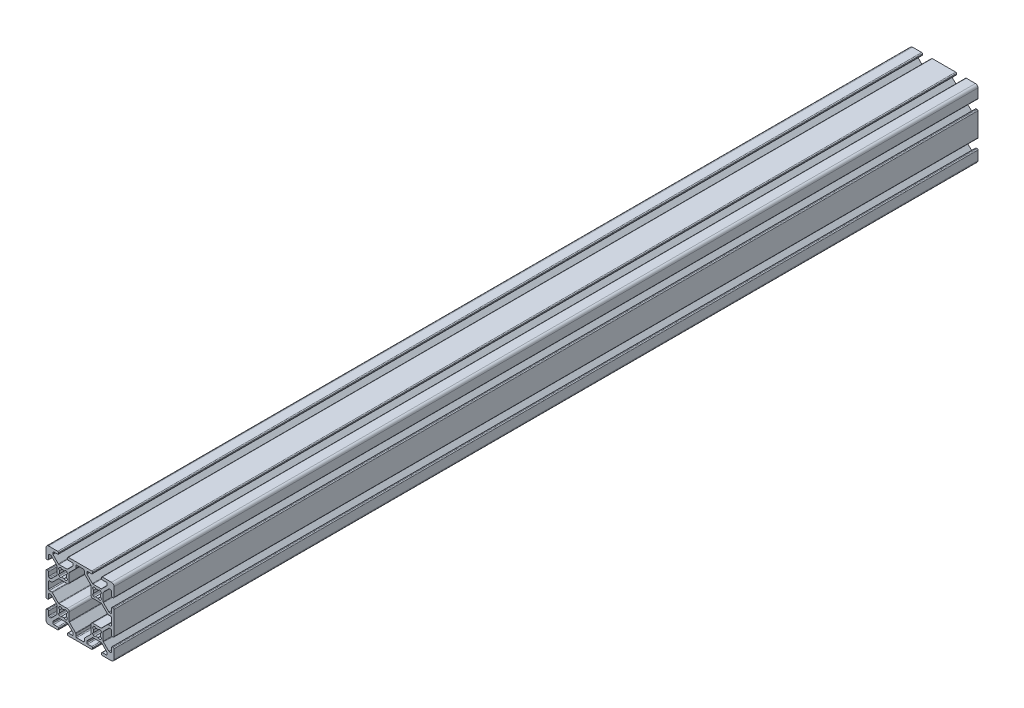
from build123d import *

# Parameters (mm, degrees)
EXTRUDE1_DEPTH = 508


with BuildPart() as part:
    # Sketch1 → Extrude1 (new body)
    with BuildSketch(Plane.XY):
        with BuildLine():
            Line((-36.908207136, -152.779600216), (-32.140368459, -152.779600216))
            ThreePointArc((-32.140368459, -152.779600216), (-31.945965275, -152.818269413), (-31.781158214, -152.928389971))
            Line((-31.781158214, -152.928389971), (-28.678077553, -156.031470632))
            ThreePointArc((-28.678077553, -156.031470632), (-28.567956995, -156.196277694), (-28.529287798, -156.390680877))
            Line((-28.529287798, -156.390680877), (-28.529287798, -157.116600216))
            ThreePointArc((-28.529287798, -157.116600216), (-28.678077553, -157.475810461), (-29.037287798, -157.624600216))
            Line((-29.037287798, -157.624600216), (-31.386287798, -157.624600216))
            ThreePointArc((-31.386287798, -157.624600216), (-31.745498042, -157.773389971), (-31.894287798, -158.132600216))
            Line((-31.894287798, -158.132600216), (-31.894287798, -158.616600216))
            ThreePointArc((-31.894287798, -158.616600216), (-31.745498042, -158.975810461), (-31.386287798, -159.124600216))
            Line((-31.386287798, -159.124600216), (-17.662287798, -159.124600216))
            ThreePointArc((-17.662287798, -159.124600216), (-17.303077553, -158.975810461), (-17.154287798, -158.616600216))
            Line((-17.154287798, -158.616600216), (-17.154287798, -158.132600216))
            ThreePointArc((-17.154287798, -158.132600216), (-17.303077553, -157.773389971), (-17.662287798, -157.624600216))
            Line((-17.662287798, -157.624600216), (-20.011287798, -157.624600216))
            ThreePointArc((-20.011287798, -157.624600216), (-20.370498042, -157.475810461), (-20.519287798, -157.116600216))
            Line((-20.519287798, -157.116600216), (-20.519287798, -156.390680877))
            ThreePointArc((-20.519287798, -156.390680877), (-20.4806186, -156.196277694), (-20.370498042, -156.031470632))
            Line((-20.370498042, -156.031470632), (-17.267417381, -152.928389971))
            ThreePointArc((-17.267417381, -152.928389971), (-17.10261032, -152.818269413), (-16.908207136, -152.779600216))
            Line((-16.908207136, -152.779600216), (-12.140368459, -152.779600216))
            ThreePointArc((-12.140368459, -152.779600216), (-11.945965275, -152.818269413), (-11.781158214, -152.928389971))
            Line((-11.781158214, -152.928389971), (-8.678077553, -156.031470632))
            ThreePointArc((-8.678077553, -156.031470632), (-8.567956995, -156.196277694), (-8.529287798, -156.390680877))
            Line((-8.529287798, -156.390680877), (-8.529287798, -157.116600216))
            ThreePointArc((-8.529287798, -157.116600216), (-8.678077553, -157.475810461), (-9.037287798, -157.624600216))
            Line((-9.037287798, -157.624600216), (-11.386287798, -157.624600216))
            ThreePointArc((-11.386287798, -157.624600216), (-11.745498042, -157.773389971), (-11.894287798, -158.132600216))
            Line((-11.894287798, -158.132600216), (-11.894287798, -158.616600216))
            ThreePointArc((-11.894287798, -158.616600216), (-11.745498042, -158.975810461), (-11.386287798, -159.124600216))
            Line((-11.386287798, -159.124600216), (-6.024287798, -159.124600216))
            ThreePointArc((-6.024287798, -159.124600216), (-4.963627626, -158.685260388), (-4.524287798, -157.624600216))
            Line((-4.524287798, -157.624600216), (-4.524287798, -152.262600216))
            ThreePointArc((-4.524287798, -152.262600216), (-4.673077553, -151.903389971), (-5.032287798, -151.754600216))
            Line((-5.032287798, -151.754600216), (-5.516287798, -151.754600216))
            ThreePointArc((-5.516287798, -151.754600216), (-5.875498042, -151.903389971), (-6.024287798, -152.262600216))
            Line((-6.024287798, -152.262600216), (-6.024287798, -154.611600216))
            ThreePointArc((-6.024287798, -154.611600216), (-6.173077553, -154.970810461), (-6.532287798, -155.119600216))
            Line((-6.532287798, -155.119600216), (-7.258207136, -155.119600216))
            ThreePointArc((-7.258207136, -155.119600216), (-7.45261032, -155.080931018), (-7.617417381, -154.970810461))
            Line((-7.617417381, -154.970810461), (-10.720498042, -151.867729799))
            ThreePointArc((-10.720498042, -151.867729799), (-10.8306186, -151.702922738), (-10.869287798, -151.508519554))
            Line((-10.869287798, -151.508519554), (-10.869287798, -146.740680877))
            ThreePointArc((-10.869287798, -146.740680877), (-10.8306186, -146.546277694), (-10.720498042, -146.381470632))
            Line((-10.720498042, -146.381470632), (-7.617417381, -143.278389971))
            ThreePointArc((-7.617417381, -143.278389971), (-7.45261032, -143.168269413), (-7.258207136, -143.129600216))
            Line((-7.258207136, -143.129600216), (-6.532287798, -143.129600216))
            ThreePointArc((-6.532287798, -143.129600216), (-6.173077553, -143.278389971), (-6.024287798, -143.637600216))
            Line((-6.024287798, -143.637600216), (-6.024287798, -145.986600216))
            ThreePointArc((-6.024287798, -145.986600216), (-5.875498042, -146.345810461), (-5.516287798, -146.494600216))
            Line((-5.516287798, -146.494600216), (-5.032287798, -146.494600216))
            ThreePointArc((-5.032287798, -146.494600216), (-4.673077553, -146.345810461), (-4.524287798, -145.986600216))
            Line((-4.524287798, -145.986600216), (-4.524287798, -132.262600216))
            ThreePointArc((-4.524287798, -132.262600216), (-4.673077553, -131.903389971), (-5.032287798, -131.754600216))
            Line((-5.032287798, -131.754600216), (-5.516287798, -131.754600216))
            ThreePointArc((-5.516287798, -131.754600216), (-5.875498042, -131.903389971), (-6.024287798, -132.262600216))
            Line((-6.024287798, -132.262600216), (-6.024287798, -134.611600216))
            ThreePointArc((-6.024287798, -134.611600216), (-6.173077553, -134.970810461), (-6.532287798, -135.119600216))
            Line((-6.532287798, -135.119600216), (-7.258207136, -135.119600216))
            ThreePointArc((-7.258207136, -135.119600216), (-7.45261032, -135.080931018), (-7.617417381, -134.970810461))
            Line((-7.617417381, -134.970810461), (-10.720498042, -131.867729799))
            ThreePointArc((-10.720498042, -131.867729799), (-10.8306186, -131.702922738), (-10.869287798, -131.508519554))
            Line((-10.869287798, -131.508519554), (-10.869287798, -126.740680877))
            ThreePointArc((-10.869287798, -126.740680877), (-10.8306186, -126.546277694), (-10.720498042, -126.381470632))
            Line((-10.720498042, -126.381470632), (-7.617417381, -123.278389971))
            ThreePointArc((-7.617417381, -123.278389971), (-7.45261032, -123.168269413), (-7.258207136, -123.129600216))
            Line((-7.258207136, -123.129600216), (-6.532287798, -123.129600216))
            ThreePointArc((-6.532287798, -123.129600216), (-6.173077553, -123.278389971), (-6.024287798, -123.637600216))
            Line((-6.024287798, -123.637600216), (-6.024287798, -125.986600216))
            ThreePointArc((-6.024287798, -125.986600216), (-5.875498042, -126.345810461), (-5.516287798, -126.494600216))
            Line((-5.516287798, -126.494600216), (-5.032287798, -126.494600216))
            ThreePointArc((-5.032287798, -126.494600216), (-4.673077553, -126.345810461), (-4.524287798, -125.986600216))
            Line((-4.524287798, -125.986600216), (-4.524287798, -120.624600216))
            ThreePointArc((-4.524287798, -120.624600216), (-4.963627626, -119.563940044), (-6.024287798, -119.124600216))
            Line((-6.024287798, -119.124600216), (-11.386287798, -119.124600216))
            ThreePointArc((-11.386287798, -119.124600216), (-11.745498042, -119.273389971), (-11.894287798, -119.632600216))
            Line((-11.894287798, -119.632600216), (-11.894287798, -120.116600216))
            ThreePointArc((-11.894287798, -120.116600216), (-11.745498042, -120.475810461), (-11.386287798, -120.624600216))
            Line((-11.386287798, -120.624600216), (-9.037287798, -120.624600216))
            ThreePointArc((-9.037287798, -120.624600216), (-8.678077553, -120.773389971), (-8.529287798, -121.132600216))
            Line((-8.529287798, -121.132600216), (-8.529287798, -121.858519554))
            ThreePointArc((-8.529287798, -121.858519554), (-8.567956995, -122.052922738), (-8.678077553, -122.217729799))
            Line((-8.678077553, -122.217729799), (-11.781158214, -125.320810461))
            ThreePointArc((-11.781158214, -125.320810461), (-11.945965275, -125.430931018), (-12.140368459, -125.469600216))
            Line((-12.140368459, -125.469600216), (-16.908207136, -125.469600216))
            ThreePointArc((-16.908207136, -125.469600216), (-17.10261032, -125.430931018), (-17.267417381, -125.320810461))
            Line((-17.267417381, -125.320810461), (-20.370498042, -122.217729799))
            ThreePointArc((-20.370498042, -122.217729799), (-20.4806186, -122.052922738), (-20.519287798, -121.858519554))
            Line((-20.519287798, -121.858519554), (-20.519287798, -121.132600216))
            ThreePointArc((-20.519287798, -121.132600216), (-20.370498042, -120.773389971), (-20.011287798, -120.624600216))
            Line((-20.011287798, -120.624600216), (-17.662287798, -120.624600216))
            ThreePointArc((-17.662287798, -120.624600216), (-17.303077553, -120.475810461), (-17.154287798, -120.116600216))
            Line((-17.154287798, -120.116600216), (-17.154287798, -119.632600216))
            ThreePointArc((-17.154287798, -119.632600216), (-17.303077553, -119.273389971), (-17.662287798, -119.124600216))
            Line((-17.662287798, -119.124600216), (-31.386287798, -119.124600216))
            ThreePointArc((-31.386287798, -119.124600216), (-31.745498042, -119.273389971), (-31.894287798, -119.632600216))
            Line((-31.894287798, -119.632600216), (-31.894287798, -120.116600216))
            ThreePointArc((-31.894287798, -120.116600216), (-31.745498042, -120.475810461), (-31.386287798, -120.624600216))
            Line((-31.386287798, -120.624600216), (-29.037287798, -120.624600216))
            ThreePointArc((-29.037287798, -120.624600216), (-28.678077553, -120.773389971), (-28.529287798, -121.132600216))
            Line((-28.529287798, -121.132600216), (-28.529287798, -121.858519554))
            ThreePointArc((-28.529287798, -121.858519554), (-28.567956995, -122.052922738), (-28.678077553, -122.217729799))
            Line((-28.678077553, -122.217729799), (-31.781158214, -125.320810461))
            ThreePointArc((-31.781158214, -125.320810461), (-31.945965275, -125.430931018), (-32.140368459, -125.469600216))
            Line((-32.140368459, -125.469600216), (-36.908207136, -125.469600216))
            ThreePointArc((-36.908207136, -125.469600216), (-37.10261032, -125.430931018), (-37.267417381, -125.320810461))
            Line((-37.267417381, -125.320810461), (-40.370498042, -122.217729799))
            ThreePointArc((-40.370498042, -122.217729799), (-40.4806186, -122.052922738), (-40.519287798, -121.858519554))
            Line((-40.519287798, -121.858519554), (-40.519287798, -121.132600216))
            ThreePointArc((-40.519287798, -121.132600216), (-40.370498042, -120.773389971), (-40.011287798, -120.624600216))
            Line((-40.011287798, -120.624600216), (-37.662287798, -120.624600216))
            ThreePointArc((-37.662287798, -120.624600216), (-37.303077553, -120.475810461), (-37.154287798, -120.116600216))
            Line((-37.154287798, -120.116600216), (-37.154287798, -119.632600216))
            ThreePointArc((-37.154287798, -119.632600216), (-37.303077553, -119.273389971), (-37.662287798, -119.124600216))
            Line((-37.662287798, -119.124600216), (-43.024287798, -119.124600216))
            ThreePointArc((-43.024287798, -119.124600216), (-44.084947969, -119.563940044), (-44.524287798, -120.624600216))
            Line((-44.524287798, -120.624600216), (-44.524287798, -125.986600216))
            ThreePointArc((-44.524287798, -125.986600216), (-44.375498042, -126.345810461), (-44.016287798, -126.494600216))
            Line((-44.016287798, -126.494600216), (-43.532287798, -126.494600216))
            ThreePointArc((-43.532287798, -126.494600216), (-43.173077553, -126.345810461), (-43.024287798, -125.986600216))
            Line((-43.024287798, -125.986600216), (-43.024287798, -123.637600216))
            ThreePointArc((-43.024287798, -123.637600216), (-42.875498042, -123.278389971), (-42.516287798, -123.129600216))
            Line((-42.516287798, -123.129600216), (-41.790368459, -123.129600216))
            ThreePointArc((-41.790368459, -123.129600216), (-41.595965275, -123.168269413), (-41.431158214, -123.278389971))
            Line((-41.431158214, -123.278389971), (-38.328077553, -126.381470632))
            ThreePointArc((-38.328077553, -126.381470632), (-38.217956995, -126.546277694), (-38.179287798, -126.740680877))
            Line((-38.179287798, -126.740680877), (-38.179287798, -131.508519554))
            ThreePointArc((-38.179287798, -131.508519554), (-38.217956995, -131.702922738), (-38.328077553, -131.867729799))
            Line((-38.328077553, -131.867729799), (-41.431158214, -134.970810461))
            ThreePointArc((-41.431158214, -134.970810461), (-41.595965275, -135.080931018), (-41.790368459, -135.119600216))
            Line((-41.790368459, -135.119600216), (-42.516287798, -135.119600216))
            ThreePointArc((-42.516287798, -135.119600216), (-42.875498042, -134.970810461), (-43.024287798, -134.611600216))
            Line((-43.024287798, -134.611600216), (-43.024287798, -132.262600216))
            ThreePointArc((-43.024287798, -132.262600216), (-43.173077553, -131.903389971), (-43.532287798, -131.754600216))
            Line((-43.532287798, -131.754600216), (-44.016287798, -131.754600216))
            ThreePointArc((-44.016287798, -131.754600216), (-44.375498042, -131.903389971), (-44.524287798, -132.262600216))
            Line((-44.524287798, -132.262600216), (-44.524287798, -145.986600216))
            ThreePointArc((-44.524287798, -145.986600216), (-44.375498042, -146.345810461), (-44.016287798, -146.494600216))
            Line((-44.016287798, -146.494600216), (-43.532287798, -146.494600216))
            ThreePointArc((-43.532287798, -146.494600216), (-43.173077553, -146.345810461), (-43.024287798, -145.986600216))
            Line((-43.024287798, -145.986600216), (-43.024287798, -143.637600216))
            ThreePointArc((-43.024287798, -143.637600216), (-42.875498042, -143.278389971), (-42.516287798, -143.129600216))
            Line((-42.516287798, -143.129600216), (-41.790368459, -143.129600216))
            ThreePointArc((-41.790368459, -143.129600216), (-41.595965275, -143.168269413), (-41.431158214, -143.278389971))
            Line((-41.431158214, -143.278389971), (-38.328077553, -146.381470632))
            ThreePointArc((-38.328077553, -146.381470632), (-38.217956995, -146.546277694), (-38.179287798, -146.740680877))
            Line((-38.179287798, -146.740680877), (-38.179287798, -151.508519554))
            ThreePointArc((-38.179287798, -151.508519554), (-38.217956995, -151.702922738), (-38.328077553, -151.867729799))
            Line((-38.328077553, -151.867729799), (-41.431158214, -154.970810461))
            ThreePointArc((-41.431158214, -154.970810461), (-41.595965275, -155.080931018), (-41.790368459, -155.119600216))
            Line((-41.790368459, -155.119600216), (-42.516287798, -155.119600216))
            ThreePointArc((-42.516287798, -155.119600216), (-42.875498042, -154.970810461), (-43.024287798, -154.611600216))
            Line((-43.024287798, -154.611600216), (-43.024287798, -152.262600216))
            ThreePointArc((-43.024287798, -152.262600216), (-43.173077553, -151.903389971), (-43.532287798, -151.754600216))
            Line((-43.532287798, -151.754600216), (-44.016287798, -151.754600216))
            ThreePointArc((-44.016287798, -151.754600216), (-44.375498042, -151.903389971), (-44.524287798, -152.262600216))
            Line((-44.524287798, -152.262600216), (-44.524287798, -157.624600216))
            ThreePointArc((-44.524287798, -157.624600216), (-44.084947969, -158.685260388), (-43.024287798, -159.124600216))
            Line((-43.024287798, -159.124600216), (-37.662287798, -159.124600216))
            ThreePointArc((-37.662287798, -159.124600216), (-37.303077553, -158.975810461), (-37.154287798, -158.616600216))
            Line((-37.154287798, -158.616600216), (-37.154287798, -158.132600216))
            ThreePointArc((-37.154287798, -158.132600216), (-37.303077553, -157.773389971), (-37.662287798, -157.624600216))
            Line((-37.662287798, -157.624600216), (-40.011287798, -157.624600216))
            ThreePointArc((-40.011287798, -157.624600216), (-40.370498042, -157.475810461), (-40.519287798, -157.116600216))
            Line((-40.519287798, -157.116600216), (-40.519287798, -156.390680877))
            ThreePointArc((-40.519287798, -156.390680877), (-40.4806186, -156.196277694), (-40.370498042, -156.031470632))
            Line((-40.370498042, -156.031470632), (-37.267417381, -152.928389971))
            ThreePointArc((-37.267417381, -152.928389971), (-37.10261032, -152.818269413), (-36.908207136, -152.779600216))
        make_face()
        with BuildLine():
            Line((-16.649188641, -131.429106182), (-16.828793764, -131.249501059))
            ThreePointArc((-16.828793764, -131.249501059), (-17.030225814, -130.481068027), (-16.459421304, -129.928576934))
            ThreePointArc((-16.459421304, -129.928576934), (-16.619787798, -129.124600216), (-16.459421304, -128.320623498))
            ThreePointArc((-16.459421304, -128.320623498), (-17.030225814, -127.768132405), (-16.828793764, -126.999699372))
            Line((-16.828793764, -126.999699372), (-16.649188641, -126.82009425))
            ThreePointArc((-16.649188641, -126.82009425), (-15.880755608, -126.618662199), (-15.328264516, -127.18946671))
            ThreePointArc((-15.328264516, -127.18946671), (-14.524287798, -127.029100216), (-13.72031108, -127.18946671))
            ThreePointArc((-13.72031108, -127.18946671), (-13.167819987, -126.618662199), (-12.399386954, -126.82009425))
            Line((-12.399386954, -126.82009425), (-12.219781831, -126.999699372))
            ThreePointArc((-12.219781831, -126.999699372), (-12.018349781, -127.768132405), (-12.589154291, -128.320623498))
            ThreePointArc((-12.589154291, -128.320623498), (-12.428787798, -129.124600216), (-12.589154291, -129.928576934))
            ThreePointArc((-12.589154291, -129.928576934), (-12.018349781, -130.481068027), (-12.219781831, -131.249501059))
            Line((-12.219781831, -131.249501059), (-12.399386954, -131.429106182))
            ThreePointArc((-12.399386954, -131.429106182), (-13.167819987, -131.630538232), (-13.72031108, -131.059733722))
            ThreePointArc((-13.72031108, -131.059733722), (-14.524287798, -131.220100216), (-15.328264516, -131.059733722))
            ThreePointArc((-15.328264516, -131.059733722), (-15.880755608, -131.630538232), (-16.649188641, -131.429106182))
        make_face(mode=Mode.SUBTRACT)
        with BuildLine():
            Line((-36.649188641, -131.429106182), (-36.828793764, -131.249501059))
            ThreePointArc((-36.828793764, -131.249501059), (-37.030225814, -130.481068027), (-36.459421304, -129.928576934))
            ThreePointArc((-36.459421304, -129.928576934), (-36.619787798, -129.124600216), (-36.459421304, -128.320623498))
            ThreePointArc((-36.459421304, -128.320623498), (-37.030225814, -127.768132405), (-36.828793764, -126.999699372))
            Line((-36.828793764, -126.999699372), (-36.649188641, -126.82009425))
            ThreePointArc((-36.649188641, -126.82009425), (-35.880755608, -126.618662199), (-35.328264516, -127.18946671))
            ThreePointArc((-35.328264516, -127.18946671), (-34.524287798, -127.029100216), (-33.72031108, -127.18946671))
            ThreePointArc((-33.72031108, -127.18946671), (-33.167819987, -126.618662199), (-32.399386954, -126.82009425))
            Line((-32.399386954, -126.82009425), (-32.219781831, -126.999699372))
            ThreePointArc((-32.219781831, -126.999699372), (-32.018349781, -127.768132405), (-32.589154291, -128.320623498))
            ThreePointArc((-32.589154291, -128.320623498), (-32.428787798, -129.124600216), (-32.589154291, -129.928576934))
            ThreePointArc((-32.589154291, -129.928576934), (-32.018349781, -130.481068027), (-32.219781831, -131.249501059))
            Line((-32.219781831, -131.249501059), (-32.399386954, -131.429106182))
            ThreePointArc((-32.399386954, -131.429106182), (-33.167819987, -131.630538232), (-33.72031108, -131.059733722))
            ThreePointArc((-33.72031108, -131.059733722), (-34.524287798, -131.220100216), (-35.328264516, -131.059733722))
            ThreePointArc((-35.328264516, -131.059733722), (-35.880755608, -131.630538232), (-36.649188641, -131.429106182))
        make_face(mode=Mode.SUBTRACT)
        with BuildLine():
            Line((-16.649188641, -151.429106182), (-16.828793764, -151.249501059))
            ThreePointArc((-16.828793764, -151.249501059), (-17.030225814, -150.481068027), (-16.459421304, -149.928576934))
            ThreePointArc((-16.459421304, -149.928576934), (-16.619787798, -149.124600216), (-16.459421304, -148.320623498))
            ThreePointArc((-16.459421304, -148.320623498), (-17.030225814, -147.768132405), (-16.828793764, -146.999699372))
            Line((-16.828793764, -146.999699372), (-16.649188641, -146.82009425))
            ThreePointArc((-16.649188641, -146.82009425), (-15.880755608, -146.618662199), (-15.328264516, -147.18946671))
            ThreePointArc((-15.328264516, -147.18946671), (-14.524287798, -147.029100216), (-13.72031108, -147.18946671))
            ThreePointArc((-13.72031108, -147.18946671), (-13.167819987, -146.618662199), (-12.399386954, -146.82009425))
            Line((-12.399386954, -146.82009425), (-12.219781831, -146.999699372))
            ThreePointArc((-12.219781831, -146.999699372), (-12.018349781, -147.768132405), (-12.589154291, -148.320623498))
            ThreePointArc((-12.589154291, -148.320623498), (-12.428787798, -149.124600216), (-12.589154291, -149.928576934))
            ThreePointArc((-12.589154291, -149.928576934), (-12.018349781, -150.481068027), (-12.219781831, -151.249501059))
            Line((-12.219781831, -151.249501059), (-12.399386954, -151.429106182))
            ThreePointArc((-12.399386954, -151.429106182), (-13.167819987, -151.630538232), (-13.72031108, -151.059733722))
            ThreePointArc((-13.72031108, -151.059733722), (-14.524287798, -151.220100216), (-15.328264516, -151.059733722))
            ThreePointArc((-15.328264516, -151.059733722), (-15.880755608, -151.630538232), (-16.649188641, -151.429106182))
        make_face(mode=Mode.SUBTRACT)
        with BuildLine():
            Line((-27.029287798, -157.116600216), (-27.029287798, -155.769360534))
            ThreePointArc((-27.029287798, -155.769360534), (-27.067956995, -155.57495735), (-27.178077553, -155.410150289))
            Line((-27.178077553, -155.410150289), (-30.720498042, -151.867729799))
            ThreePointArc((-30.720498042, -151.867729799), (-30.8306186, -151.702922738), (-30.869287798, -151.508519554))
            Line((-30.869287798, -151.508519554), (-30.869287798, -146.612600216))
            ThreePointArc((-30.869287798, -146.612600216), (-31.204064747, -145.804377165), (-32.012287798, -145.469600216))
            Line((-32.012287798, -145.469600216), (-36.908207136, -145.469600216))
            ThreePointArc((-36.908207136, -145.469600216), (-37.10261032, -145.430931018), (-37.267417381, -145.320810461))
            Line((-37.267417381, -145.320810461), (-40.809837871, -141.778389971))
            ThreePointArc((-40.809837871, -141.778389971), (-40.974644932, -141.668269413), (-41.169048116, -141.629600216))
            Line((-41.169048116, -141.629600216), (-42.516287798, -141.629600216))
            ThreePointArc((-42.516287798, -141.629600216), (-42.875498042, -141.480810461), (-43.024287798, -141.121600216))
            Line((-43.024287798, -141.121600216), (-43.024287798, -137.127600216))
            ThreePointArc((-43.024287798, -137.127600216), (-42.875498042, -136.768389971), (-42.516287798, -136.619600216))
            Line((-42.516287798, -136.619600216), (-41.169048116, -136.619600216))
            ThreePointArc((-41.169048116, -136.619600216), (-40.974644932, -136.580931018), (-40.809837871, -136.470810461))
            Line((-40.809837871, -136.470810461), (-37.267417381, -132.928389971))
            ThreePointArc((-37.267417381, -132.928389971), (-37.10261032, -132.818269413), (-36.908207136, -132.779600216))
            Line((-36.908207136, -132.779600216), (-32.012287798, -132.779600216))
            ThreePointArc((-32.012287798, -132.779600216), (-31.204064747, -132.444823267), (-30.869287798, -131.636600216))
            Line((-30.869287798, -131.636600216), (-30.869287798, -126.740680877))
            ThreePointArc((-30.869287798, -126.740680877), (-30.8306186, -126.546277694), (-30.720498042, -126.381470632))
            Line((-30.720498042, -126.381470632), (-27.178077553, -122.839050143))
            ThreePointArc((-27.178077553, -122.839050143), (-27.067956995, -122.674243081), (-27.029287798, -122.479839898))
            Line((-27.029287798, -122.479839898), (-27.029287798, -121.132600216))
            ThreePointArc((-27.029287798, -121.132600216), (-26.880498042, -120.773389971), (-26.521287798, -120.624600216))
            Line((-26.521287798, -120.624600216), (-22.527287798, -120.624600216))
            ThreePointArc((-22.527287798, -120.624600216), (-22.168077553, -120.773389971), (-22.019287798, -121.132600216))
            Line((-22.019287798, -121.132600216), (-22.019287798, -122.479839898))
            ThreePointArc((-22.019287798, -122.479839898), (-21.9806186, -122.674243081), (-21.870498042, -122.839050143))
            Line((-21.870498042, -122.839050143), (-18.328077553, -126.381470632))
            ThreePointArc((-18.328077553, -126.381470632), (-18.217956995, -126.546277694), (-18.179287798, -126.740680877))
            Line((-18.179287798, -126.740680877), (-18.179287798, -131.636600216))
            ThreePointArc((-18.179287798, -131.636600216), (-17.844510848, -132.444823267), (-17.036287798, -132.779600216))
            Line((-17.036287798, -132.779600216), (-12.140368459, -132.779600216))
            ThreePointArc((-12.140368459, -132.779600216), (-11.945965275, -132.818269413), (-11.781158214, -132.928389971))
            Line((-11.781158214, -132.928389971), (-8.238737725, -136.470810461))
            ThreePointArc((-8.238737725, -136.470810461), (-8.073930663, -136.580931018), (-7.87952748, -136.619600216))
            Line((-7.87952748, -136.619600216), (-6.532287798, -136.619600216))
            ThreePointArc((-6.532287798, -136.619600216), (-6.173077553, -136.768389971), (-6.024287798, -137.127600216))
            Line((-6.024287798, -137.127600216), (-6.024287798, -141.121600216))
            ThreePointArc((-6.024287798, -141.121600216), (-6.173077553, -141.480810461), (-6.532287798, -141.629600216))
            Line((-6.532287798, -141.629600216), (-7.87952748, -141.629600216))
            ThreePointArc((-7.87952748, -141.629600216), (-8.073930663, -141.668269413), (-8.238737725, -141.778389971))
            Line((-8.238737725, -141.778389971), (-11.781158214, -145.320810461))
            ThreePointArc((-11.781158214, -145.320810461), (-11.945965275, -145.430931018), (-12.140368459, -145.469600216))
            Line((-12.140368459, -145.469600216), (-17.036287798, -145.469600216))
            ThreePointArc((-17.036287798, -145.469600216), (-17.844510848, -145.804377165), (-18.179287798, -146.612600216))
            Line((-18.179287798, -146.612600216), (-18.179287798, -151.508519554))
            ThreePointArc((-18.179287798, -151.508519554), (-18.217956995, -151.702922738), (-18.328077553, -151.867729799))
            Line((-18.328077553, -151.867729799), (-21.870498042, -155.410150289))
            ThreePointArc((-21.870498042, -155.410150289), (-21.9806186, -155.57495735), (-22.019287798, -155.769360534))
            Line((-22.019287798, -155.769360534), (-22.019287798, -157.116600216))
            ThreePointArc((-22.019287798, -157.116600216), (-22.168077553, -157.475810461), (-22.527287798, -157.624600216))
            Line((-22.527287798, -157.624600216), (-26.521287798, -157.624600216))
            ThreePointArc((-26.521287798, -157.624600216), (-26.880498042, -157.475810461), (-27.029287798, -157.116600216))
        make_face(mode=Mode.SUBTRACT)
        with BuildLine():
            Line((-36.649188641, -151.429106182), (-36.828793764, -151.249501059))
            ThreePointArc((-36.828793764, -151.249501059), (-37.030225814, -150.481068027), (-36.459421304, -149.928576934))
            ThreePointArc((-36.459421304, -149.928576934), (-36.619787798, -149.124600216), (-36.459421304, -148.320623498))
            ThreePointArc((-36.459421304, -148.320623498), (-37.030225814, -147.768132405), (-36.828793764, -146.999699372))
            Line((-36.828793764, -146.999699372), (-36.649188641, -146.82009425))
            ThreePointArc((-36.649188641, -146.82009425), (-35.880755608, -146.618662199), (-35.328264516, -147.18946671))
            ThreePointArc((-35.328264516, -147.18946671), (-34.524287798, -147.029100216), (-33.72031108, -147.18946671))
            ThreePointArc((-33.72031108, -147.18946671), (-33.167819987, -146.618662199), (-32.399386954, -146.82009425))
            Line((-32.399386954, -146.82009425), (-32.219781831, -146.999699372))
            ThreePointArc((-32.219781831, -146.999699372), (-32.018349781, -147.768132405), (-32.589154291, -148.320623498))
            ThreePointArc((-32.589154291, -148.320623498), (-32.428787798, -149.124600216), (-32.589154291, -149.928576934))
            ThreePointArc((-32.589154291, -149.928576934), (-32.018349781, -150.481068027), (-32.219781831, -151.249501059))
            Line((-32.219781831, -151.249501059), (-32.399386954, -151.429106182))
            ThreePointArc((-32.399386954, -151.429106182), (-33.167819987, -151.630538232), (-33.72031108, -151.059733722))
            ThreePointArc((-33.72031108, -151.059733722), (-34.524287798, -151.220100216), (-35.328264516, -151.059733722))
            ThreePointArc((-35.328264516, -151.059733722), (-35.880755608, -151.630538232), (-36.649188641, -151.429106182))
        make_face(mode=Mode.SUBTRACT)
    extrude(amount=EXTRUDE1_DEPTH)


solid = part.part
